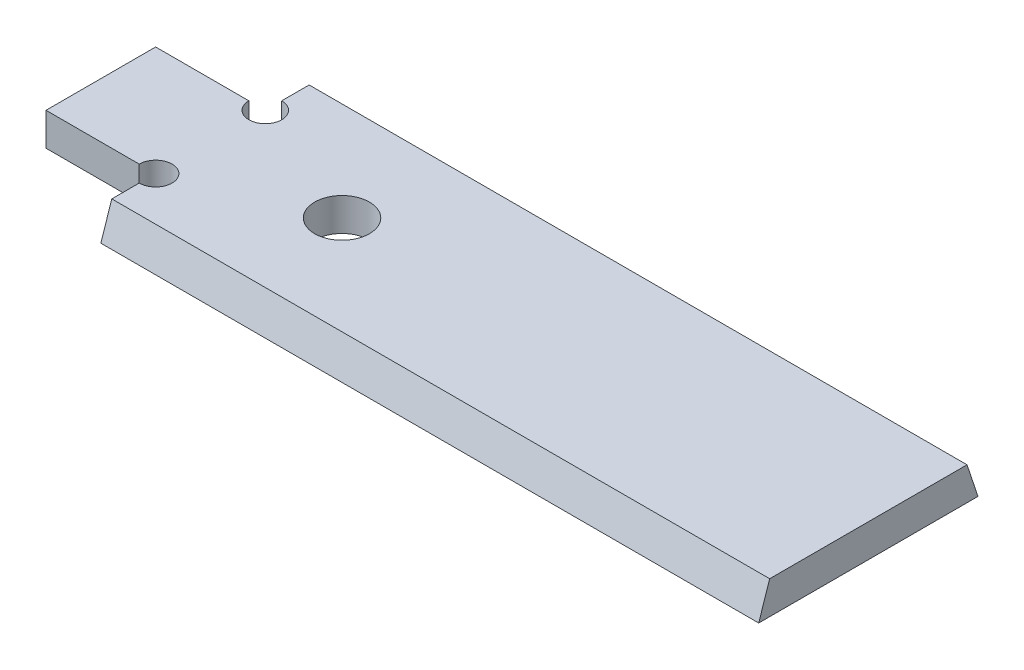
from build123d import *

# Parameters (mm, degrees)
SKETCH1_R          = 2.5
EXTRUDE1_DEPTH     = 3
CUT_EXTRUDE1_DEPTH = 73.862884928


with BuildPart() as part:
    # Sketch1 → Extrude1 (new body)
    with BuildSketch(Plane(origin=(0, 0, 0), x_dir=(1, 0, 0), z_dir=(0, 1, 0))):
        with BuildLine():
            Line((10, 0), (10, 3.5))
            ThreePointArc((10, 3.5), (11.060660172, 6.060660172), (8.5, 5))
            Line((8.5, 5), (0, 5))
            Line((0, 5), (0, 15))
            Line((0, 15), (8.5, 15))
            ThreePointArc((8.5, 15), (11.060660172, 13.939339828), (10, 16.5))
            Line((10, 16.5), (10, 20))
            Line((10, 20), (70, 20))
            Line((70, 20), (70, 0))
            Line((70, 0), (10, 0))
        make_face()
        with Locations(Location((22, 10, 0), (0, 0, 270))):
            Circle(SKETCH1_R, mode=Mode.SUBTRACT)
    extrude(amount=EXTRUDE1_DEPTH)

    # Sketch2 → Cut-Extrude1 (cut, through all)
    with BuildSketch(Plane(origin=(70, 0, 0), x_dir=(0, 0, -1), z_dir=(1, 0, 0))):
        Polygon((0, 0), (0, 3), (1, 3), align=None)
        Polygon((20, 0), (20, 3), (19, 3), align=None)
    extrude(amount=-CUT_EXTRUDE1_DEPTH, mode=Mode.SUBTRACT)


solid = part.part
